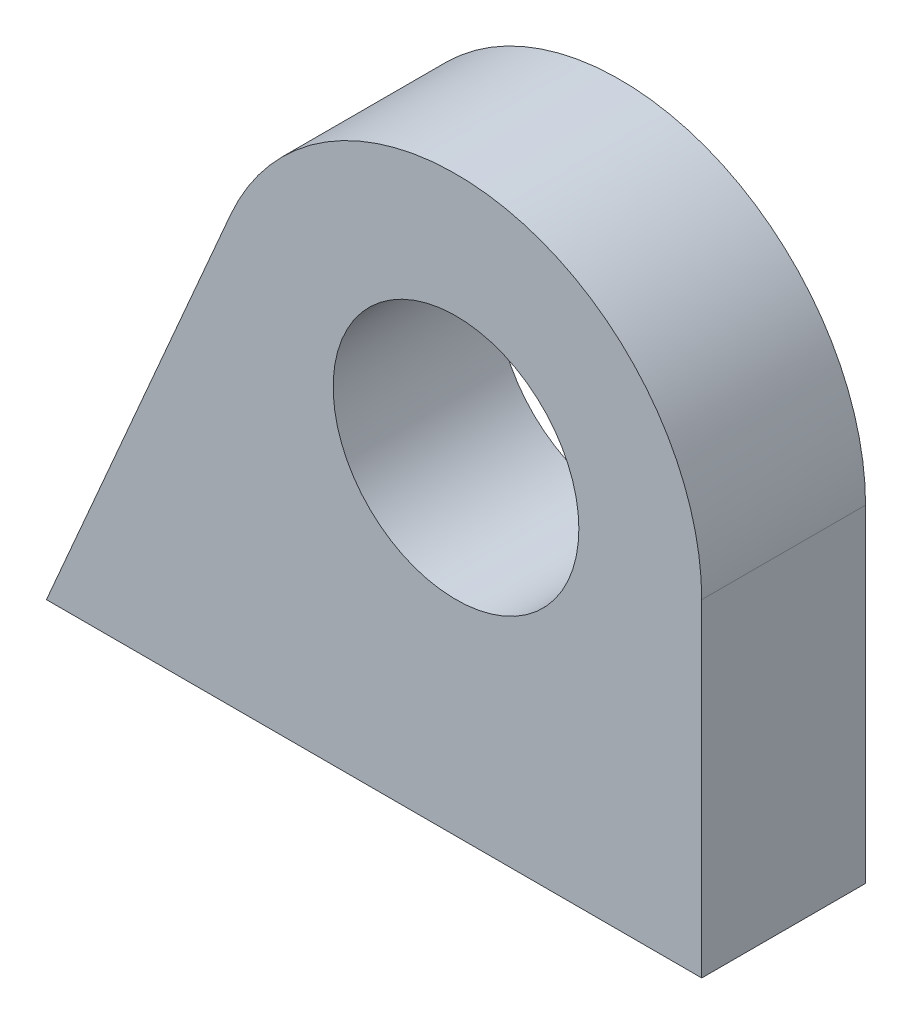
ISO-10303-21;
HEADER;
FILE_DESCRIPTION(('STEP AP214'),'2;1');
FILE_NAME('part.step','',(''),(''),'','','');
FILE_SCHEMA(('AUTOMOTIVE_DESIGN { 1 0 10303 214 1 1 1 1 }'));
ENDSEC;
DATA;
#1=APPLICATION_CONTEXT('core data for automotive mechanical design processes');
#2=APPLICATION_PROTOCOL_DEFINITION('international standard','automotive_design',2000,#1);
#3=PRODUCT_CONTEXT('',#1,'mechanical');
#4=PRODUCT('Part','Part','',(#3));
#5=PRODUCT_RELATED_PRODUCT_CATEGORY('part','',(#4));
#6=PRODUCT_DEFINITION_FORMATION('','',#4);
#7=PRODUCT_DEFINITION_CONTEXT('part definition',#1,'design');
#8=PRODUCT_DEFINITION('design','',#6,#7);
#9=PRODUCT_DEFINITION_SHAPE('','',#8);
#10=(LENGTH_UNIT() NAMED_UNIT(*) SI_UNIT(.MILLI.,.METRE.));
#11=(NAMED_UNIT(*) PLANE_ANGLE_UNIT() SI_UNIT($,.RADIAN.));
#12=(NAMED_UNIT(*) SI_UNIT($,.STERADIAN.) SOLID_ANGLE_UNIT());
#13=UNCERTAINTY_MEASURE_WITH_UNIT(LENGTH_MEASURE(1.E-05),#10,'distance_accuracy_value','');
#14=(GEOMETRIC_REPRESENTATION_CONTEXT(3) GLOBAL_UNCERTAINTY_ASSIGNED_CONTEXT((#13)) GLOBAL_UNIT_ASSIGNED_CONTEXT((#10,
#11,#12)) REPRESENTATION_CONTEXT('',''));
#15=CARTESIAN_POINT('',(0.,0.,0.));
#16=DIRECTION('',(0.,0.,1.));
#17=DIRECTION('',(1.,0.,0.));
#18=AXIS2_PLACEMENT_3D('',#15,#16,#17);
#19=CARTESIAN_POINT('',(-640.,305.,-5.));
#20=DIRECTION('',(-0.917741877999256,0.397177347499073,0.));
#21=DIRECTION('',(-0.397177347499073,-0.917741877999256,0.));
#22=AXIS2_PLACEMENT_3D('',#19,#20,#21);
#23=PLANE('',#22);
#24=DIRECTION('',(0.,0.,1.));
#25=VECTOR('',#24,1.);
#26=CARTESIAN_POINT('',(-640.,305.,-5.));
#27=LINE('',#26,#25);
#28=CARTESIAN_POINT('',(-640.,305.,-5.));
#29=VERTEX_POINT('',#28);
#30=CARTESIAN_POINT('',(-640.,305.,5.));
#31=VERTEX_POINT('',#30);
#32=EDGE_CURVE('E33',#29,#31,#27,.T.);
#33=ORIENTED_EDGE('',*,*,#32,.T.);
#34=DIRECTION('',(-0.397177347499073,-0.917741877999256,0.));
#35=VECTOR('',#34,1.);
#36=CARTESIAN_POINT('',(-640.,305.,5.));
#37=LINE('',#36,#35);
#38=CARTESIAN_POINT('',(-628.766128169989,330.957660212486,5.));
#39=VERTEX_POINT('',#38);
#40=EDGE_CURVE('E70',#39,#31,#37,.T.);
#41=ORIENTED_EDGE('',*,*,#40,.F.);
#42=DIRECTION('',(0.,0.,1.));
#43=VECTOR('',#42,1.);
#44=CARTESIAN_POINT('',(-628.766128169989,330.957660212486,-5.));
#45=LINE('',#44,#43);
#46=CARTESIAN_POINT('',(-628.766128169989,330.957660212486,-5.));
#47=VERTEX_POINT('',#46);
#48=EDGE_CURVE('E11',#47,#39,#45,.T.);
#49=ORIENTED_EDGE('',*,*,#48,.F.);
#50=DIRECTION('',(-0.397177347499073,-0.917741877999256,0.));
#51=VECTOR('',#50,1.);
#52=CARTESIAN_POINT('',(-640.,305.,-5.));
#53=LINE('',#52,#51);
#54=EDGE_CURVE('E71',#47,#29,#53,.T.);
#55=ORIENTED_EDGE('',*,*,#54,.T.);
#56=EDGE_LOOP('',(#33,#41,#49,#55));
#57=FACE_BOUND('',#56,.T.);
#58=ADVANCED_FACE('F30',(#57),#23,.T.);
#59=CARTESIAN_POINT('',(-615.,325.,-5.));
#60=DIRECTION('',(0.,0.,1.));
#61=DIRECTION('',(1.,0.,0.));
#62=AXIS2_PLACEMENT_3D('',#59,#60,#61);
#63=CYLINDRICAL_SURFACE('',#62,15.);
#64=ORIENTED_EDGE('',*,*,#48,.T.);
#65=CARTESIAN_POINT('',(-615.,325.,5.));
#66=DIRECTION('',(0.,0.,1.));
#67=DIRECTION('',(1.,0.,0.));
#68=AXIS2_PLACEMENT_3D('',#65,#66,#67);
#69=CIRCLE('',#68,15.);
#70=CARTESIAN_POINT('',(-600.,325.,5.));
#71=VERTEX_POINT('',#70);
#72=EDGE_CURVE('E88',#71,#39,#69,.T.);
#73=ORIENTED_EDGE('',*,*,#72,.F.);
#74=DIRECTION('',(0.,0.,1.));
#75=VECTOR('',#74,1.);
#76=CARTESIAN_POINT('',(-600.,325.,-5.));
#77=LINE('',#76,#75);
#78=CARTESIAN_POINT('',(-600.,325.,-5.));
#79=VERTEX_POINT('',#78);
#80=EDGE_CURVE('E38',#79,#71,#77,.T.);
#81=ORIENTED_EDGE('',*,*,#80,.F.);
#82=CARTESIAN_POINT('',(-615.,325.,-5.));
#83=DIRECTION('',(0.,0.,1.));
#84=DIRECTION('',(1.,0.,0.));
#85=AXIS2_PLACEMENT_3D('',#82,#83,#84);
#86=CIRCLE('',#85,15.);
#87=EDGE_CURVE('E76',#79,#47,#86,.T.);
#88=ORIENTED_EDGE('',*,*,#87,.T.);
#89=EDGE_LOOP('',(#64,#73,#81,#88));
#90=FACE_BOUND('',#89,.T.);
#91=ADVANCED_FACE('F109',(#90),#63,.T.);
#92=CARTESIAN_POINT('',(-600.,305.,-5.));
#93=DIRECTION('',(1.,0.,0.));
#94=DIRECTION('',(0.,1.,0.));
#95=AXIS2_PLACEMENT_3D('',#92,#93,#94);
#96=PLANE('',#95);
#97=ORIENTED_EDGE('',*,*,#80,.T.);
#98=DIRECTION('',(0.,1.,0.));
#99=VECTOR('',#98,1.);
#100=CARTESIAN_POINT('',(-600.,305.,5.));
#101=LINE('',#100,#99);
#102=CARTESIAN_POINT('',(-600.,305.,5.));
#103=VERTEX_POINT('',#102);
#104=EDGE_CURVE('E83',#103,#71,#101,.T.);
#105=ORIENTED_EDGE('',*,*,#104,.F.);
#106=DIRECTION('',(0.,0.,1.));
#107=VECTOR('',#106,1.);
#108=CARTESIAN_POINT('',(-600.,305.,-5.));
#109=LINE('',#108,#107);
#110=CARTESIAN_POINT('',(-600.,305.,-5.));
#111=VERTEX_POINT('',#110);
#112=EDGE_CURVE('E75',#111,#103,#109,.T.);
#113=ORIENTED_EDGE('',*,*,#112,.F.);
#114=DIRECTION('',(0.,1.,0.));
#115=VECTOR('',#114,1.);
#116=CARTESIAN_POINT('',(-600.,305.,-5.));
#117=LINE('',#116,#115);
#118=EDGE_CURVE('E102',#111,#79,#117,.T.);
#119=ORIENTED_EDGE('',*,*,#118,.T.);
#120=EDGE_LOOP('',(#97,#105,#113,#119));
#121=FACE_BOUND('',#120,.T.);
#122=ADVANCED_FACE('F106',(#121),#96,.T.);
#123=CARTESIAN_POINT('',(-640.,305.,-5.));
#124=DIRECTION('',(0.,-1.,0.));
#125=DIRECTION('',(0.,0.,-1.));
#126=AXIS2_PLACEMENT_3D('',#123,#124,#125);
#127=PLANE('',#126);
#128=ORIENTED_EDGE('',*,*,#112,.T.);
#129=DIRECTION('',(1.,0.,0.));
#130=VECTOR('',#129,1.);
#131=CARTESIAN_POINT('',(-640.,305.,5.));
#132=LINE('',#131,#130);
#133=EDGE_CURVE('E78',#31,#103,#132,.T.);
#134=ORIENTED_EDGE('',*,*,#133,.F.);
#135=ORIENTED_EDGE('',*,*,#32,.F.);
#136=DIRECTION('',(1.,0.,0.));
#137=VECTOR('',#136,1.);
#138=CARTESIAN_POINT('',(-640.,305.,-5.));
#139=LINE('',#138,#137);
#140=EDGE_CURVE('E100',#29,#111,#139,.T.);
#141=ORIENTED_EDGE('',*,*,#140,.T.);
#142=EDGE_LOOP('',(#128,#134,#135,#141));
#143=FACE_BOUND('',#142,.T.);
#144=ADVANCED_FACE('F79',(#143),#127,.T.);
#145=CARTESIAN_POINT('',(-615.,325.,-5.));
#146=DIRECTION('',(0.,0.,1.));
#147=DIRECTION('',(1.,0.,0.));
#148=AXIS2_PLACEMENT_3D('',#145,#146,#147);
#149=PLANE('',#148);
#150=CARTESIAN_POINT('',(-615.,325.,-5.));
#151=DIRECTION('',(0.,0.,1.));
#152=DIRECTION('',(1.,0.,0.));
#153=AXIS2_PLACEMENT_3D('',#150,#151,#152);
#154=CIRCLE('',#153,7.49999999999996);
#155=CARTESIAN_POINT('',(-607.5,325.,-5.));
#156=VERTEX_POINT('',#155);
#157=EDGE_CURVE('E96',#156,#156,#154,.T.);
#158=ORIENTED_EDGE('',*,*,#157,.T.);
#159=EDGE_LOOP('',(#158));
#160=FACE_BOUND('',#159,.T.);
#161=ORIENTED_EDGE('',*,*,#54,.F.);
#162=ORIENTED_EDGE('',*,*,#87,.F.);
#163=ORIENTED_EDGE('',*,*,#118,.F.);
#164=ORIENTED_EDGE('',*,*,#140,.F.);
#165=EDGE_LOOP('',(#161,#162,#163,#164));
#166=FACE_BOUND('',#165,.T.);
#167=ADVANCED_FACE('F111',(#160,#166),#149,.F.);
#168=CARTESIAN_POINT('',(-615.,325.,-5.));
#169=DIRECTION('',(0.,0.,1.));
#170=DIRECTION('',(1.,0.,0.));
#171=AXIS2_PLACEMENT_3D('',#168,#169,#170);
#172=CYLINDRICAL_SURFACE('',#171,7.49999999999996);
#173=ORIENTED_EDGE('',*,*,#157,.F.);
#174=EDGE_LOOP('',(#173));
#175=FACE_BOUND('',#174,.T.);
#176=CARTESIAN_POINT('',(-615.,325.,5.));
#177=DIRECTION('',(0.,0.,1.));
#178=DIRECTION('',(1.,0.,0.));
#179=AXIS2_PLACEMENT_3D('',#176,#177,#178);
#180=CIRCLE('',#179,7.49999999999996);
#181=CARTESIAN_POINT('',(-607.5,325.,5.));
#182=VERTEX_POINT('',#181);
#183=EDGE_CURVE('E89',#182,#182,#180,.T.);
#184=ORIENTED_EDGE('',*,*,#183,.T.);
#185=EDGE_LOOP('',(#184));
#186=FACE_BOUND('',#185,.T.);
#187=ADVANCED_FACE('F113',(#175,#186),#172,.F.);
#188=CARTESIAN_POINT('',(-615.,325.,5.));
#189=DIRECTION('',(0.,0.,1.));
#190=DIRECTION('',(1.,0.,0.));
#191=AXIS2_PLACEMENT_3D('',#188,#189,#190);
#192=PLANE('',#191);
#193=ORIENTED_EDGE('',*,*,#40,.T.);
#194=ORIENTED_EDGE('',*,*,#133,.T.);
#195=ORIENTED_EDGE('',*,*,#104,.T.);
#196=ORIENTED_EDGE('',*,*,#72,.T.);
#197=EDGE_LOOP('',(#193,#194,#195,#196));
#198=FACE_BOUND('',#197,.T.);
#199=ORIENTED_EDGE('',*,*,#183,.F.);
#200=EDGE_LOOP('',(#199));
#201=FACE_BOUND('',#200,.T.);
#202=ADVANCED_FACE('F86',(#198,#201),#192,.T.);
#203=CLOSED_SHELL('',(#58,#91,#122,#144,#167,#187,#202));
#204=MANIFOLD_SOLID_BREP('B2',#203);
#205=ADVANCED_BREP_SHAPE_REPRESENTATION('',(#18,#204),#14);
#206=SHAPE_DEFINITION_REPRESENTATION(#9,#205);
ENDSEC;
END-ISO-10303-21;
